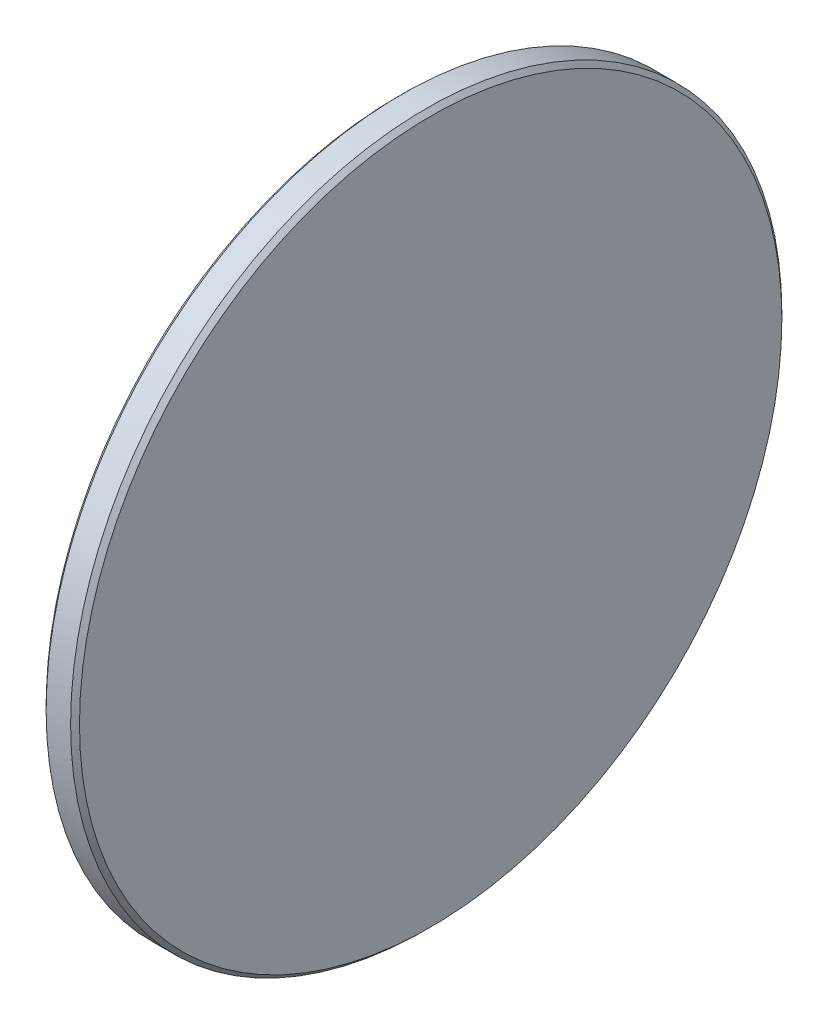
ISO-10303-21;
HEADER;
FILE_DESCRIPTION(('STEP AP214'),'2;1');
FILE_NAME('part.step','',(''),(''),'','','');
FILE_SCHEMA(('AUTOMOTIVE_DESIGN { 1 0 10303 214 1 1 1 1 }'));
ENDSEC;
DATA;
#1=APPLICATION_CONTEXT('core data for automotive mechanical design processes');
#2=APPLICATION_PROTOCOL_DEFINITION('international standard','automotive_design',2000,#1);
#3=PRODUCT_CONTEXT('',#1,'mechanical');
#4=PRODUCT('Part','Part','',(#3));
#5=PRODUCT_RELATED_PRODUCT_CATEGORY('part','',(#4));
#6=PRODUCT_DEFINITION_FORMATION('','',#4);
#7=PRODUCT_DEFINITION_CONTEXT('part definition',#1,'design');
#8=PRODUCT_DEFINITION('design','',#6,#7);
#9=PRODUCT_DEFINITION_SHAPE('','',#8);
#10=(LENGTH_UNIT() NAMED_UNIT(*) SI_UNIT(.MILLI.,.METRE.));
#11=(NAMED_UNIT(*) PLANE_ANGLE_UNIT() SI_UNIT($,.RADIAN.));
#12=(NAMED_UNIT(*) SI_UNIT($,.STERADIAN.) SOLID_ANGLE_UNIT());
#13=UNCERTAINTY_MEASURE_WITH_UNIT(LENGTH_MEASURE(1.E-05),#10,'distance_accuracy_value','');
#14=(GEOMETRIC_REPRESENTATION_CONTEXT(3) GLOBAL_UNCERTAINTY_ASSIGNED_CONTEXT((#13)) GLOBAL_UNIT_ASSIGNED_CONTEXT((#10,
#11,#12)) REPRESENTATION_CONTEXT('',''));
#15=CARTESIAN_POINT('',(0.,0.,0.));
#16=DIRECTION('',(0.,0.,1.));
#17=DIRECTION('',(1.,0.,0.));
#18=AXIS2_PLACEMENT_3D('',#15,#16,#17);
#19=CARTESIAN_POINT('',(9.525,0.,0.));
#20=DIRECTION('',(-1.,0.,0.));
#21=DIRECTION('',(0.,0.,1.));
#22=AXIS2_PLACEMENT_3D('',#19,#20,#21);
#23=CYLINDRICAL_SURFACE('',#22,101.6);
#24=CARTESIAN_POINT('',(8.25500000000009,0.,0.));
#25=DIRECTION('',(1.,0.,0.));
#26=DIRECTION('',(0.,0.,-1.));
#27=AXIS2_PLACEMENT_3D('',#24,#25,#26);
#28=CIRCLE('',#27,101.6);
#29=CARTESIAN_POINT('',(8.25500000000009,0.,101.6));
#30=VERTEX_POINT('',#29);
#31=EDGE_CURVE('E38',#30,#30,#28,.F.);
#32=CARTESIAN_POINT('',(1.27000000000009,0.,0.));
#33=DIRECTION('',(1.,0.,0.));
#34=DIRECTION('',(0.,0.,-1.));
#35=AXIS2_PLACEMENT_3D('',#32,#33,#34);
#36=CIRCLE('',#35,101.6);
#37=CARTESIAN_POINT('',(1.27000000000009,0.,101.6));
#38=VERTEX_POINT('',#37);
#39=EDGE_CURVE('E42',#38,#38,#36,.T.);
#40=CARTESIAN_POINT('',(8.25500000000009,0.,101.6));
#41=CARTESIAN_POINT('',(8.18223958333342,0.,101.6));
#42=CARTESIAN_POINT('',(8.10947916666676,0.,101.6));
#43=CARTESIAN_POINT('',(7.96395833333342,0.,101.6));
#44=CARTESIAN_POINT('',(7.89119791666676,0.,101.6));
#45=CARTESIAN_POINT('',(7.74567708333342,0.,101.6));
#46=CARTESIAN_POINT('',(7.67291666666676,0.,101.6));
#47=CARTESIAN_POINT('',(7.52739583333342,0.,101.6));
#48=CARTESIAN_POINT('',(7.45463541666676,0.,101.6));
#49=CARTESIAN_POINT('',(7.30911458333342,0.,101.6));
#50=CARTESIAN_POINT('',(7.23635416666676,0.,101.6));
#51=CARTESIAN_POINT('',(7.09083333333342,0.,101.6));
#52=CARTESIAN_POINT('',(7.01807291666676,0.,101.6));
#53=CARTESIAN_POINT('',(6.87255208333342,0.,101.6));
#54=CARTESIAN_POINT('',(6.79979166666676,0.,101.6));
#55=CARTESIAN_POINT('',(6.65427083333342,0.,101.6));
#56=CARTESIAN_POINT('',(6.58151041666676,0.,101.6));
#57=CARTESIAN_POINT('',(6.43598958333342,0.,101.6));
#58=CARTESIAN_POINT('',(6.36322916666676,0.,101.6));
#59=CARTESIAN_POINT('',(6.21770833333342,0.,101.6));
#60=CARTESIAN_POINT('',(6.14494791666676,0.,101.6));
#61=CARTESIAN_POINT('',(5.99942708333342,0.,101.6));
#62=CARTESIAN_POINT('',(5.92666666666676,0.,101.6));
#63=CARTESIAN_POINT('',(5.78114583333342,0.,101.6));
#64=CARTESIAN_POINT('',(5.70838541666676,0.,101.6));
#65=CARTESIAN_POINT('',(5.56286458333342,0.,101.6));
#66=CARTESIAN_POINT('',(5.49010416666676,0.,101.6));
#67=CARTESIAN_POINT('',(5.34458333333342,0.,101.6));
#68=CARTESIAN_POINT('',(5.27182291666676,0.,101.6));
#69=CARTESIAN_POINT('',(5.12630208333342,0.,101.6));
#70=CARTESIAN_POINT('',(5.05354166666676,0.,101.6));
#71=CARTESIAN_POINT('',(4.90802083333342,0.,101.6));
#72=CARTESIAN_POINT('',(4.83526041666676,0.,101.6));
#73=CARTESIAN_POINT('',(4.68973958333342,0.,101.6));
#74=CARTESIAN_POINT('',(4.61697916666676,0.,101.6));
#75=CARTESIAN_POINT('',(4.47145833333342,0.,101.6));
#76=CARTESIAN_POINT('',(4.39869791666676,0.,101.6));
#77=CARTESIAN_POINT('',(4.25317708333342,0.,101.6));
#78=CARTESIAN_POINT('',(4.18041666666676,0.,101.6));
#79=CARTESIAN_POINT('',(4.03489583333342,0.,101.6));
#80=CARTESIAN_POINT('',(3.96213541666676,0.,101.6));
#81=CARTESIAN_POINT('',(3.81661458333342,0.,101.6));
#82=CARTESIAN_POINT('',(3.74385416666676,0.,101.6));
#83=CARTESIAN_POINT('',(3.59833333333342,0.,101.6));
#84=CARTESIAN_POINT('',(3.52557291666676,0.,101.6));
#85=CARTESIAN_POINT('',(3.38005208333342,0.,101.6));
#86=CARTESIAN_POINT('',(3.30729166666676,0.,101.6));
#87=CARTESIAN_POINT('',(3.16177083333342,0.,101.6));
#88=CARTESIAN_POINT('',(3.08901041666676,0.,101.6));
#89=CARTESIAN_POINT('',(2.94348958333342,0.,101.6));
#90=CARTESIAN_POINT('',(2.87072916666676,0.,101.6));
#91=CARTESIAN_POINT('',(2.72520833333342,0.,101.6));
#92=CARTESIAN_POINT('',(2.65244791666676,0.,101.6));
#93=CARTESIAN_POINT('',(2.50692708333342,0.,101.6));
#94=CARTESIAN_POINT('',(2.43416666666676,0.,101.6));
#95=CARTESIAN_POINT('',(2.28864583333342,0.,101.6));
#96=CARTESIAN_POINT('',(2.21588541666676,0.,101.6));
#97=CARTESIAN_POINT('',(2.07036458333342,0.,101.6));
#98=CARTESIAN_POINT('',(1.99760416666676,0.,101.6));
#99=CARTESIAN_POINT('',(1.85208333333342,0.,101.6));
#100=CARTESIAN_POINT('',(1.77932291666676,0.,101.6));
#101=CARTESIAN_POINT('',(1.63380208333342,0.,101.6));
#102=CARTESIAN_POINT('',(1.56104166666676,0.,101.6));
#103=CARTESIAN_POINT('',(1.41552083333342,0.,101.6));
#104=CARTESIAN_POINT('',(1.34276041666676,0.,101.6));
#105=CARTESIAN_POINT('',(1.27000000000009,0.,101.6));
#106=B_SPLINE_CURVE_WITH_KNOTS('',3,(#40,#41,#42,#43,#44,#45,#46,#47,#48,#49,#50,#51,#52,#53,
#54,#55,#56,#57,#58,#59,#60,#61,#62,#63,#64,#65,#66,#67,#68,#69,#70,#71,#72,#73,#74,#75,#76,#77,
#78,#79,#80,#81,#82,#83,#84,#85,#86,#87,#88,#89,#90,#91,#92,#93,#94,#95,#96,#97,#98,#99,#100,
#101,#102,#103,#104,#105),.UNSPECIFIED.,.F.,.F.,(4,2,2,2,2,2,2,2,2,2,2,2,2,2,2,2,2,2,2,2,2,2,2,
2,2,2,2,2,2,2,2,2,4),(0.,0.218281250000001,0.436562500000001,0.654843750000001,
0.873125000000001,1.09140625,1.3096875,1.52796875,1.74625,1.96453125,2.1828125,2.40109375,
2.619375,2.83765625,3.0559375,3.27421875,3.4925,3.71078125,3.9290625,4.14734375,4.365625,
4.58390625,4.8021875,5.02046875,5.23875,5.45703125,5.6753125,5.89359375,6.111875,6.33015625,
6.5484375,6.76671875,6.985),.UNSPECIFIED.);
#107=EDGE_CURVE('BSEAM31',#30,#38,#106,.T.);
#108=ORIENTED_EDGE('',*,*,#31,.T.);
#109=ORIENTED_EDGE('',*,*,#39,.T.);
#110=ORIENTED_EDGE('',*,*,#107,.T.);
#111=ORIENTED_EDGE('',*,*,#107,.F.);
#112=EDGE_LOOP('',(#108,#110,#109,#111));
#113=FACE_BOUND('',#112,.T.);
#114=ADVANCED_FACE('F31',(#113),#23,.T.);
#115=CARTESIAN_POINT('',(9.525,0.,0.));
#116=DIRECTION('',(1.,0.,0.));
#117=DIRECTION('',(0.,0.,-1.));
#118=AXIS2_PLACEMENT_3D('',#115,#116,#117);
#119=PLANE('',#118);
#120=CARTESIAN_POINT('',(9.525,0.,0.));
#121=DIRECTION('',(1.,0.,0.));
#122=DIRECTION('',(0.,0.,-1.));
#123=AXIS2_PLACEMENT_3D('',#120,#121,#122);
#124=CIRCLE('',#123,100.33);
#125=CARTESIAN_POINT('',(9.525,0.,-100.33));
#126=VERTEX_POINT('',#125);
#127=EDGE_CURVE('E46',#126,#126,#124,.T.);
#128=ORIENTED_EDGE('',*,*,#127,.T.);
#129=EDGE_LOOP('',(#128));
#130=FACE_BOUND('',#129,.T.);
#131=ADVANCED_FACE('F52',(#130),#119,.T.);
#132=CARTESIAN_POINT('',(0.,0.,0.));
#133=DIRECTION('',(1.,0.,0.));
#134=DIRECTION('',(0.,0.,-1.));
#135=AXIS2_PLACEMENT_3D('',#132,#133,#134);
#136=PLANE('',#135);
#137=CARTESIAN_POINT('',(0.,0.,0.));
#138=DIRECTION('',(1.,0.,0.));
#139=DIRECTION('',(0.,0.,-1.));
#140=AXIS2_PLACEMENT_3D('',#137,#138,#139);
#141=CIRCLE('',#140,100.33);
#142=CARTESIAN_POINT('',(0.,0.,-100.33));
#143=VERTEX_POINT('',#142);
#144=EDGE_CURVE('E10',#143,#143,#141,.F.);
#145=ORIENTED_EDGE('',*,*,#144,.T.);
#146=EDGE_LOOP('',(#145));
#147=FACE_BOUND('',#146,.T.);
#148=ADVANCED_FACE('F56',(#147),#136,.F.);
#149=CARTESIAN_POINT('',(9.525,0.,0.));
#150=DIRECTION('',(-1.,0.,0.));
#151=DIRECTION('',(0.,0.,1.));
#152=AXIS2_PLACEMENT_3D('',#149,#150,#151);
#153=CONICAL_SURFACE('',#152,100.33,0.785398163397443);
#154=ORIENTED_EDGE('',*,*,#31,.F.);
#155=EDGE_LOOP('',(#154));
#156=FACE_BOUND('',#155,.T.);
#157=ORIENTED_EDGE('',*,*,#127,.F.);
#158=EDGE_LOOP('',(#157));
#159=FACE_BOUND('',#158,.T.);
#160=ADVANCED_FACE('F54',(#156,#159),#153,.T.);
#161=CARTESIAN_POINT('',(1.27000000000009,0.,0.));
#162=DIRECTION('',(1.,0.,0.));
#163=DIRECTION('',(0.,0.,-1.));
#164=AXIS2_PLACEMENT_3D('',#161,#162,#163);
#165=CONICAL_SURFACE('',#164,101.6,0.785398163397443);
#166=ORIENTED_EDGE('',*,*,#144,.F.);
#167=EDGE_LOOP('',(#166));
#168=FACE_BOUND('',#167,.T.);
#169=ORIENTED_EDGE('',*,*,#39,.F.);
#170=EDGE_LOOP('',(#169));
#171=FACE_BOUND('',#170,.T.);
#172=ADVANCED_FACE('F33',(#168,#171),#165,.T.);
#173=CLOSED_SHELL('',(#114,#131,#148,#160,#172));
#174=MANIFOLD_SOLID_BREP('B2',#173);
#175=ADVANCED_BREP_SHAPE_REPRESENTATION('',(#18,#174),#14);
#176=SHAPE_DEFINITION_REPRESENTATION(#9,#175);
ENDSEC;
END-ISO-10303-21;
